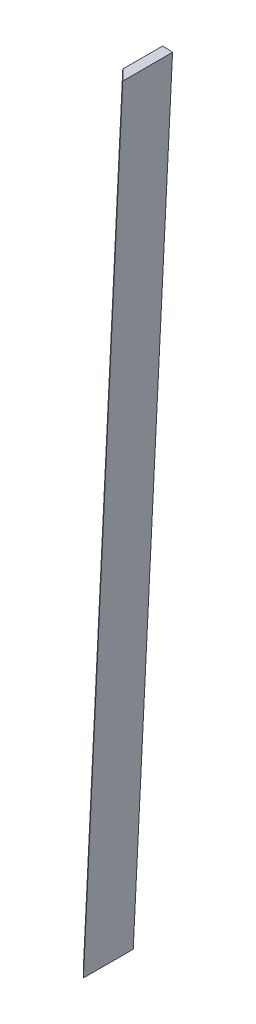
from build123d import *

# Parameters (mm, degrees)
EXTRUDE1_DEPTH      = 2002.437435
EXTRUDE1_DEPTH_BACK = 2002.437435


with BuildPart() as part:
    # Sketch5 → Extrude1 (new, two sides: drawn at the far end of the back side and taken through both)
    with BuildSketch(Plane(origin=(98.770851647, 2000, 0), x_dir=(0.9987827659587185, -0.04932531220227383, 0), z_dir=(-0.04932531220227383, -0.9987827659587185, 0)).offset(-EXTRUDE1_DEPTH_BACK)):
        Polygon((-63.981264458, -264.181148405), (-64.103061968, -64.181185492), (-14.133520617, -14.150745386), (-13.98127373, -264.150699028), align=None)
    extrude(amount=EXTRUDE1_DEPTH + EXTRUDE1_DEPTH_BACK)


solid = part.part
